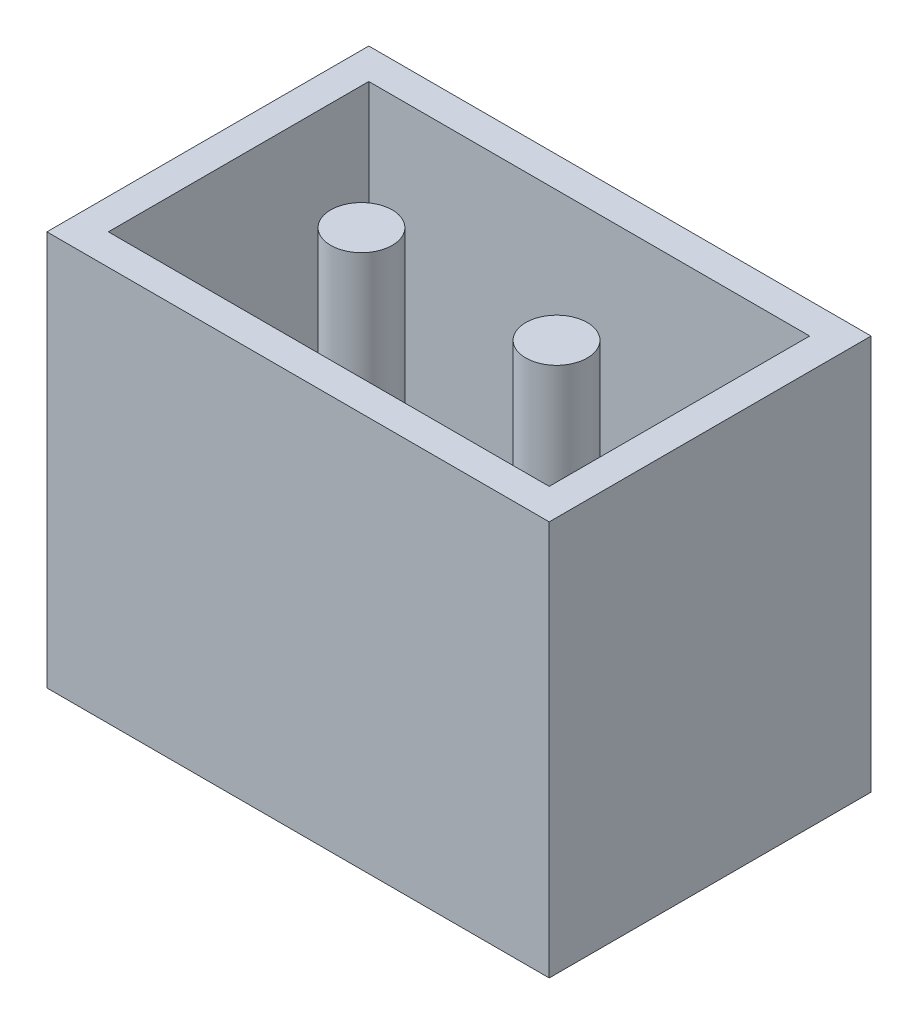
ISO-10303-21;
HEADER;
FILE_DESCRIPTION(('STEP AP214'),'2;1');
FILE_NAME('part.step','',(''),(''),'','','');
FILE_SCHEMA(('AUTOMOTIVE_DESIGN { 1 0 10303 214 1 1 1 1 }'));
ENDSEC;
DATA;
#1=APPLICATION_CONTEXT('core data for automotive mechanical design processes');
#2=APPLICATION_PROTOCOL_DEFINITION('international standard','automotive_design',2000,#1);
#3=PRODUCT_CONTEXT('',#1,'mechanical');
#4=PRODUCT('Part','Part','',(#3));
#5=PRODUCT_RELATED_PRODUCT_CATEGORY('part','',(#4));
#6=PRODUCT_DEFINITION_FORMATION('','',#4);
#7=PRODUCT_DEFINITION_CONTEXT('part definition',#1,'design');
#8=PRODUCT_DEFINITION('design','',#6,#7);
#9=PRODUCT_DEFINITION_SHAPE('','',#8);
#10=(LENGTH_UNIT() NAMED_UNIT(*) SI_UNIT(.MILLI.,.METRE.));
#11=(NAMED_UNIT(*) PLANE_ANGLE_UNIT() SI_UNIT($,.RADIAN.));
#12=(NAMED_UNIT(*) SI_UNIT($,.STERADIAN.) SOLID_ANGLE_UNIT());
#13=UNCERTAINTY_MEASURE_WITH_UNIT(LENGTH_MEASURE(1.E-05),#10,'distance_accuracy_value','');
#14=(GEOMETRIC_REPRESENTATION_CONTEXT(3) GLOBAL_UNCERTAINTY_ASSIGNED_CONTEXT((#13)) GLOBAL_UNIT_ASSIGNED_CONTEXT((#10,
#11,#12)) REPRESENTATION_CONTEXT('',''));
#15=CARTESIAN_POINT('',(0.,0.,0.));
#16=DIRECTION('',(0.,0.,1.));
#17=DIRECTION('',(1.,0.,0.));
#18=AXIS2_PLACEMENT_3D('',#15,#16,#17);
#19=CARTESIAN_POINT('',(0.,10.287,0.));
#20=DIRECTION('',(1.,0.,0.));
#21=DIRECTION('',(0.,0.,-1.));
#22=AXIS2_PLACEMENT_3D('',#19,#20,#21);
#23=PLANE('',#22);
#24=DIRECTION('',(0.,0.,1.));
#25=VECTOR('',#24,1.);
#26=CARTESIAN_POINT('',(0.,0.,0.));
#27=LINE('',#26,#25);
#28=CARTESIAN_POINT('',(0.,0.,-8.382));
#29=VERTEX_POINT('',#28);
#30=CARTESIAN_POINT('',(0.,0.,0.));
#31=VERTEX_POINT('',#30);
#32=EDGE_CURVE('E132',#29,#31,#27,.T.);
#33=ORIENTED_EDGE('',*,*,#32,.T.);
#34=DIRECTION('',(0.,-1.,0.));
#35=VECTOR('',#34,1.);
#36=CARTESIAN_POINT('',(0.,10.287,0.));
#37=LINE('',#36,#35);
#38=CARTESIAN_POINT('',(0.,10.287,0.));
#39=VERTEX_POINT('',#38);
#40=EDGE_CURVE('E11',#39,#31,#37,.T.);
#41=ORIENTED_EDGE('',*,*,#40,.F.);
#42=DIRECTION('',(0.,0.,1.));
#43=VECTOR('',#42,1.);
#44=CARTESIAN_POINT('',(0.,10.287,0.));
#45=LINE('',#44,#43);
#46=CARTESIAN_POINT('',(0.,10.287,-8.382));
#47=VERTEX_POINT('',#46);
#48=EDGE_CURVE('E143',#47,#39,#45,.T.);
#49=ORIENTED_EDGE('',*,*,#48,.F.);
#50=DIRECTION('',(0.,-1.,0.));
#51=VECTOR('',#50,1.);
#52=CARTESIAN_POINT('',(0.,10.287,-8.382));
#53=LINE('',#52,#51);
#54=EDGE_CURVE('E150',#47,#29,#53,.T.);
#55=ORIENTED_EDGE('',*,*,#54,.T.);
#56=EDGE_LOOP('',(#33,#41,#49,#55));
#57=FACE_BOUND('',#56,.T.);
#58=ADVANCED_FACE('F30',(#57),#23,.F.);
#59=CARTESIAN_POINT('',(0.,10.287,0.));
#60=DIRECTION('',(0.,0.,-1.));
#61=DIRECTION('',(-1.,0.,0.));
#62=AXIS2_PLACEMENT_3D('',#59,#60,#61);
#63=PLANE('',#62);
#64=DIRECTION('',(1.,0.,0.));
#65=VECTOR('',#64,1.);
#66=CARTESIAN_POINT('',(0.,0.,0.));
#67=LINE('',#66,#65);
#68=CARTESIAN_POINT('',(13.081,0.,0.));
#69=VERTEX_POINT('',#68);
#70=EDGE_CURVE('E137',#31,#69,#67,.T.);
#71=ORIENTED_EDGE('',*,*,#70,.T.);
#72=DIRECTION('',(0.,-1.,0.));
#73=VECTOR('',#72,1.);
#74=CARTESIAN_POINT('',(13.081,10.287,0.));
#75=LINE('',#74,#73);
#76=CARTESIAN_POINT('',(13.081,10.287,0.));
#77=VERTEX_POINT('',#76);
#78=EDGE_CURVE('E37',#77,#69,#75,.T.);
#79=ORIENTED_EDGE('',*,*,#78,.F.);
#80=DIRECTION('',(1.,0.,0.));
#81=VECTOR('',#80,1.);
#82=CARTESIAN_POINT('',(0.,10.287,0.));
#83=LINE('',#82,#81);
#84=EDGE_CURVE('E145',#39,#77,#83,.T.);
#85=ORIENTED_EDGE('',*,*,#84,.F.);
#86=ORIENTED_EDGE('',*,*,#40,.T.);
#87=EDGE_LOOP('',(#71,#79,#85,#86));
#88=FACE_BOUND('',#87,.T.);
#89=ADVANCED_FACE('F172',(#88),#63,.F.);
#90=CARTESIAN_POINT('',(13.081,10.287,0.));
#91=DIRECTION('',(-1.,0.,0.));
#92=DIRECTION('',(0.,0.,1.));
#93=AXIS2_PLACEMENT_3D('',#90,#91,#92);
#94=PLANE('',#93);
#95=DIRECTION('',(0.,0.,-1.));
#96=VECTOR('',#95,1.);
#97=CARTESIAN_POINT('',(13.081,0.,0.));
#98=LINE('',#97,#96);
#99=CARTESIAN_POINT('',(13.081,0.,-8.382));
#100=VERTEX_POINT('',#99);
#101=EDGE_CURVE('E139',#69,#100,#98,.T.);
#102=ORIENTED_EDGE('',*,*,#101,.T.);
#103=DIRECTION('',(0.,-1.,0.));
#104=VECTOR('',#103,1.);
#105=CARTESIAN_POINT('',(13.081,10.287,-8.382));
#106=LINE('',#105,#104);
#107=CARTESIAN_POINT('',(13.081,10.287,-8.382));
#108=VERTEX_POINT('',#107);
#109=EDGE_CURVE('E153',#108,#100,#106,.T.);
#110=ORIENTED_EDGE('',*,*,#109,.F.);
#111=DIRECTION('',(0.,0.,-1.));
#112=VECTOR('',#111,1.);
#113=CARTESIAN_POINT('',(13.081,10.287,0.));
#114=LINE('',#113,#112);
#115=EDGE_CURVE('E147',#77,#108,#114,.T.);
#116=ORIENTED_EDGE('',*,*,#115,.F.);
#117=ORIENTED_EDGE('',*,*,#78,.T.);
#118=EDGE_LOOP('',(#102,#110,#116,#117));
#119=FACE_BOUND('',#118,.T.);
#120=ADVANCED_FACE('F160',(#119),#94,.F.);
#121=CARTESIAN_POINT('',(0.,10.287,-8.382));
#122=DIRECTION('',(0.,0.,1.));
#123=DIRECTION('',(1.,0.,0.));
#124=AXIS2_PLACEMENT_3D('',#121,#122,#123);
#125=PLANE('',#124);
#126=DIRECTION('',(-1.,0.,0.));
#127=VECTOR('',#126,1.);
#128=CARTESIAN_POINT('',(0.,0.,-8.382));
#129=LINE('',#128,#127);
#130=EDGE_CURVE('E141',#100,#29,#129,.T.);
#131=ORIENTED_EDGE('',*,*,#130,.T.);
#132=ORIENTED_EDGE('',*,*,#54,.F.);
#133=DIRECTION('',(-1.,0.,0.));
#134=VECTOR('',#133,1.);
#135=CARTESIAN_POINT('',(0.,10.287,-8.382));
#136=LINE('',#135,#134);
#137=EDGE_CURVE('E52',#108,#47,#136,.T.);
#138=ORIENTED_EDGE('',*,*,#137,.F.);
#139=ORIENTED_EDGE('',*,*,#109,.T.);
#140=EDGE_LOOP('',(#131,#132,#138,#139));
#141=FACE_BOUND('',#140,.T.);
#142=ADVANCED_FACE('F168',(#141),#125,.F.);
#143=CARTESIAN_POINT('',(0.,10.287,-8.382));
#144=DIRECTION('',(0.,-1.,0.));
#145=DIRECTION('',(0.,0.,-1.));
#146=AXIS2_PLACEMENT_3D('',#143,#144,#145);
#147=PLANE('',#146);
#148=DIRECTION('',(-1.,0.,0.));
#149=VECTOR('',#148,1.);
#150=CARTESIAN_POINT('',(12.2809,10.287,-7.5819));
#151=LINE('',#150,#149);
#152=CARTESIAN_POINT('',(12.2809,10.287,-7.5819));
#153=VERTEX_POINT('',#152);
#154=CARTESIAN_POINT('',(0.800100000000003,10.287,-7.5819));
#155=VERTEX_POINT('',#154);
#156=EDGE_CURVE('E110',#153,#155,#151,.T.);
#157=ORIENTED_EDGE('',*,*,#156,.F.);
#158=DIRECTION('',(0.,0.,-1.));
#159=VECTOR('',#158,1.);
#160=CARTESIAN_POINT('',(12.2809,10.287,-0.8001));
#161=LINE('',#160,#159);
#162=CARTESIAN_POINT('',(12.2809,10.287,-0.8001));
#163=VERTEX_POINT('',#162);
#164=EDGE_CURVE('E44',#163,#153,#161,.T.);
#165=ORIENTED_EDGE('',*,*,#164,.F.);
#166=DIRECTION('',(1.,0.,0.));
#167=VECTOR('',#166,1.);
#168=CARTESIAN_POINT('',(12.2809,10.287,-0.8001));
#169=LINE('',#168,#167);
#170=CARTESIAN_POINT('',(0.800100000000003,10.287,-0.8001));
#171=VERTEX_POINT('',#170);
#172=EDGE_CURVE('E116',#171,#163,#169,.T.);
#173=ORIENTED_EDGE('',*,*,#172,.F.);
#174=DIRECTION('',(0.,0.,1.));
#175=VECTOR('',#174,1.);
#176=CARTESIAN_POINT('',(0.800100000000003,10.287,-0.8001));
#177=LINE('',#176,#175);
#178=EDGE_CURVE('E99',#155,#171,#177,.T.);
#179=ORIENTED_EDGE('',*,*,#178,.F.);
#180=EDGE_LOOP('',(#157,#165,#173,#179));
#181=FACE_BOUND('',#180,.T.);
#182=ORIENTED_EDGE('',*,*,#48,.T.);
#183=ORIENTED_EDGE('',*,*,#84,.T.);
#184=ORIENTED_EDGE('',*,*,#115,.T.);
#185=ORIENTED_EDGE('',*,*,#137,.T.);
#186=EDGE_LOOP('',(#182,#183,#184,#185));
#187=FACE_BOUND('',#186,.T.);
#188=ADVANCED_FACE('F114',(#181,#187),#147,.F.);
#189=CARTESIAN_POINT('',(0.,0.,-8.382));
#190=DIRECTION('',(0.,-1.,0.));
#191=DIRECTION('',(0.,0.,-1.));
#192=AXIS2_PLACEMENT_3D('',#189,#190,#191);
#193=PLANE('',#192);
#194=ORIENTED_EDGE('',*,*,#32,.F.);
#195=ORIENTED_EDGE('',*,*,#130,.F.);
#196=ORIENTED_EDGE('',*,*,#101,.F.);
#197=ORIENTED_EDGE('',*,*,#70,.F.);
#198=EDGE_LOOP('',(#194,#195,#196,#197));
#199=FACE_BOUND('',#198,.T.);
#200=ADVANCED_FACE('F166',(#199),#193,.T.);
#201=CARTESIAN_POINT('',(12.2809,2.3495,-0.8001));
#202=DIRECTION('',(1.,0.,0.));
#203=DIRECTION('',(0.,0.,-1.));
#204=AXIS2_PLACEMENT_3D('',#201,#202,#203);
#205=PLANE('',#204);
#206=ORIENTED_EDGE('',*,*,#164,.T.);
#207=DIRECTION('',(0.,1.,0.));
#208=VECTOR('',#207,1.);
#209=CARTESIAN_POINT('',(12.2809,2.3495,-7.5819));
#210=LINE('',#209,#208);
#211=CARTESIAN_POINT('',(12.2809,2.3495,-7.5819));
#212=VERTEX_POINT('',#211);
#213=EDGE_CURVE('E107',#212,#153,#210,.T.);
#214=ORIENTED_EDGE('',*,*,#213,.F.);
#215=DIRECTION('',(0.,0.,-1.));
#216=VECTOR('',#215,1.);
#217=CARTESIAN_POINT('',(12.2809,2.3495,-0.8001));
#218=LINE('',#217,#216);
#219=CARTESIAN_POINT('',(12.2809,2.3495,-0.8001));
#220=VERTEX_POINT('',#219);
#221=EDGE_CURVE('E118',#220,#212,#218,.T.);
#222=ORIENTED_EDGE('',*,*,#221,.F.);
#223=DIRECTION('',(0.,1.,0.));
#224=VECTOR('',#223,1.);
#225=CARTESIAN_POINT('',(12.2809,2.3495,-0.8001));
#226=LINE('',#225,#224);
#227=EDGE_CURVE('E130',#220,#163,#226,.T.);
#228=ORIENTED_EDGE('',*,*,#227,.T.);
#229=EDGE_LOOP('',(#206,#214,#222,#228));
#230=FACE_BOUND('',#229,.T.);
#231=ADVANCED_FACE('F188',(#230),#205,.F.);
#232=CARTESIAN_POINT('',(12.2809,2.3495,-0.8001));
#233=DIRECTION('',(0.,0.,1.));
#234=DIRECTION('',(1.,0.,0.));
#235=AXIS2_PLACEMENT_3D('',#232,#233,#234);
#236=PLANE('',#235);
#237=ORIENTED_EDGE('',*,*,#172,.T.);
#238=ORIENTED_EDGE('',*,*,#227,.F.);
#239=DIRECTION('',(1.,0.,0.));
#240=VECTOR('',#239,1.);
#241=CARTESIAN_POINT('',(12.2809,2.3495,-0.8001));
#242=LINE('',#241,#240);
#243=CARTESIAN_POINT('',(0.800100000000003,2.3495,-0.8001));
#244=VERTEX_POINT('',#243);
#245=EDGE_CURVE('E127',#244,#220,#242,.T.);
#246=ORIENTED_EDGE('',*,*,#245,.F.);
#247=DIRECTION('',(0.,1.,0.));
#248=VECTOR('',#247,1.);
#249=CARTESIAN_POINT('',(0.800100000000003,2.3495,-0.8001));
#250=LINE('',#249,#248);
#251=EDGE_CURVE('E106',#244,#171,#250,.T.);
#252=ORIENTED_EDGE('',*,*,#251,.T.);
#253=EDGE_LOOP('',(#237,#238,#246,#252));
#254=FACE_BOUND('',#253,.T.);
#255=ADVANCED_FACE('F191',(#254),#236,.F.);
#256=CARTESIAN_POINT('',(0.800100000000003,2.3495,-0.8001));
#257=DIRECTION('',(-1.,0.,0.));
#258=DIRECTION('',(0.,0.,1.));
#259=AXIS2_PLACEMENT_3D('',#256,#257,#258);
#260=PLANE('',#259);
#261=ORIENTED_EDGE('',*,*,#178,.T.);
#262=ORIENTED_EDGE('',*,*,#251,.F.);
#263=DIRECTION('',(0.,0.,1.));
#264=VECTOR('',#263,1.);
#265=CARTESIAN_POINT('',(0.800100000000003,2.3495,-0.8001));
#266=LINE('',#265,#264);
#267=CARTESIAN_POINT('',(0.800100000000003,2.3495,-7.5819));
#268=VERTEX_POINT('',#267);
#269=EDGE_CURVE('E102',#268,#244,#266,.T.);
#270=ORIENTED_EDGE('',*,*,#269,.F.);
#271=DIRECTION('',(0.,1.,0.));
#272=VECTOR('',#271,1.);
#273=CARTESIAN_POINT('',(0.800100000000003,2.3495,-7.5819));
#274=LINE('',#273,#272);
#275=EDGE_CURVE('E95',#268,#155,#274,.T.);
#276=ORIENTED_EDGE('',*,*,#275,.T.);
#277=EDGE_LOOP('',(#261,#262,#270,#276));
#278=FACE_BOUND('',#277,.T.);
#279=ADVANCED_FACE('F97',(#278),#260,.F.);
#280=CARTESIAN_POINT('',(12.2809,2.3495,-7.5819));
#281=DIRECTION('',(0.,0.,-1.));
#282=DIRECTION('',(-1.,0.,0.));
#283=AXIS2_PLACEMENT_3D('',#280,#281,#282);
#284=PLANE('',#283);
#285=ORIENTED_EDGE('',*,*,#156,.T.);
#286=ORIENTED_EDGE('',*,*,#275,.F.);
#287=DIRECTION('',(-1.,0.,0.));
#288=VECTOR('',#287,1.);
#289=CARTESIAN_POINT('',(12.2809,2.3495,-7.5819));
#290=LINE('',#289,#288);
#291=EDGE_CURVE('E124',#212,#268,#290,.T.);
#292=ORIENTED_EDGE('',*,*,#291,.F.);
#293=ORIENTED_EDGE('',*,*,#213,.T.);
#294=EDGE_LOOP('',(#285,#286,#292,#293));
#295=FACE_BOUND('',#294,.T.);
#296=ADVANCED_FACE('F111',(#295),#284,.F.);
#297=CARTESIAN_POINT('',(12.2809,2.3495,-7.5819));
#298=DIRECTION('',(0.,1.,0.));
#299=DIRECTION('',(0.,0.,1.));
#300=AXIS2_PLACEMENT_3D('',#297,#298,#299);
#301=PLANE('',#300);
#302=CARTESIAN_POINT('',(4.0005,2.3495,-4.191));
#303=DIRECTION('',(0.,1.,0.));
#304=DIRECTION('',(0.,0.,-1.));
#305=AXIS2_PLACEMENT_3D('',#302,#303,#304);
#306=CIRCLE('',#305,0.8001);
#307=CARTESIAN_POINT('',(4.0005,2.3495,-4.9911));
#308=VERTEX_POINT('',#307);
#309=EDGE_CURVE('E217',#308,#308,#306,.T.);
#310=ORIENTED_EDGE('',*,*,#309,.F.);
#311=EDGE_LOOP('',(#310));
#312=FACE_BOUND('',#311,.T.);
#313=CARTESIAN_POINT('',(9.08050000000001,2.3495,-4.191));
#314=DIRECTION('',(0.,1.,0.));
#315=DIRECTION('',(0.,0.,1.));
#316=AXIS2_PLACEMENT_3D('',#313,#314,#315);
#317=CIRCLE('',#316,0.8001);
#318=CARTESIAN_POINT('',(9.08050000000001,2.3495,-3.3909));
#319=VERTEX_POINT('',#318);
#320=EDGE_CURVE('E228',#319,#319,#317,.T.);
#321=ORIENTED_EDGE('',*,*,#320,.F.);
#322=EDGE_LOOP('',(#321));
#323=FACE_BOUND('',#322,.T.);
#324=ORIENTED_EDGE('',*,*,#221,.T.);
#325=ORIENTED_EDGE('',*,*,#291,.T.);
#326=ORIENTED_EDGE('',*,*,#269,.T.);
#327=ORIENTED_EDGE('',*,*,#245,.T.);
#328=EDGE_LOOP('',(#324,#325,#326,#327));
#329=FACE_BOUND('',#328,.T.);
#330=ADVANCED_FACE('F194',(#312,#323,#329),#301,.T.);
#331=CARTESIAN_POINT('',(9.08050000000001,2.3495,-4.191));
#332=DIRECTION('',(0.,1.,0.));
#333=DIRECTION('',(0.,0.,1.));
#334=AXIS2_PLACEMENT_3D('',#331,#332,#333);
#335=CYLINDRICAL_SURFACE('',#334,0.8001);
#336=ORIENTED_EDGE('',*,*,#320,.T.);
#337=EDGE_LOOP('',(#336));
#338=FACE_BOUND('',#337,.T.);
#339=CARTESIAN_POINT('',(9.08050000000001,10.287,-4.191));
#340=DIRECTION('',(0.,1.,0.));
#341=DIRECTION('',(0.,0.,1.));
#342=AXIS2_PLACEMENT_3D('',#339,#340,#341);
#343=CIRCLE('',#342,0.8001);
#344=CARTESIAN_POINT('',(9.08050000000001,10.287,-3.3909));
#345=VERTEX_POINT('',#344);
#346=EDGE_CURVE('E223',#345,#345,#343,.T.);
#347=ORIENTED_EDGE('',*,*,#346,.F.);
#348=EDGE_LOOP('',(#347));
#349=FACE_BOUND('',#348,.T.);
#350=ADVANCED_FACE('F202',(#338,#349),#335,.T.);
#351=CARTESIAN_POINT('',(4.0005,2.3495,-4.191));
#352=DIRECTION('',(0.,1.,0.));
#353=DIRECTION('',(0.,0.,1.));
#354=AXIS2_PLACEMENT_3D('',#351,#352,#353);
#355=CYLINDRICAL_SURFACE('',#354,0.8001);
#356=ORIENTED_EDGE('',*,*,#309,.T.);
#357=EDGE_LOOP('',(#356));
#358=FACE_BOUND('',#357,.T.);
#359=CARTESIAN_POINT('',(4.0005,10.287,-4.191));
#360=DIRECTION('',(0.,1.,0.));
#361=DIRECTION('',(0.,0.,-1.));
#362=AXIS2_PLACEMENT_3D('',#359,#360,#361);
#363=CIRCLE('',#362,0.8001);
#364=CARTESIAN_POINT('',(4.0005,10.287,-4.9911));
#365=VERTEX_POINT('',#364);
#366=EDGE_CURVE('E220',#365,#365,#363,.T.);
#367=ORIENTED_EDGE('',*,*,#366,.F.);
#368=EDGE_LOOP('',(#367));
#369=FACE_BOUND('',#368,.T.);
#370=ADVANCED_FACE('F206',(#358,#369),#355,.T.);
#371=ORIENTED_EDGE('',*,*,#346,.T.);
#372=EDGE_LOOP('',(#371));
#373=FACE_BOUND('',#372,.T.);
#374=ADVANCED_FACE('F184',(#373),#147,.F.);
#375=ORIENTED_EDGE('',*,*,#366,.T.);
#376=EDGE_LOOP('',(#375));
#377=FACE_BOUND('',#376,.T.);
#378=ADVANCED_FACE('F185',(#377),#147,.F.);
#379=CLOSED_SHELL('',(#58,#89,#120,#142,#188,#200,#231,#255,#279,#296,#330,#350,#370,#374,#378));
#380=MANIFOLD_SOLID_BREP('B2',#379);
#381=ADVANCED_BREP_SHAPE_REPRESENTATION('',(#18,#380),#14);
#382=SHAPE_DEFINITION_REPRESENTATION(#9,#381);
ENDSEC;
END-ISO-10303-21;
